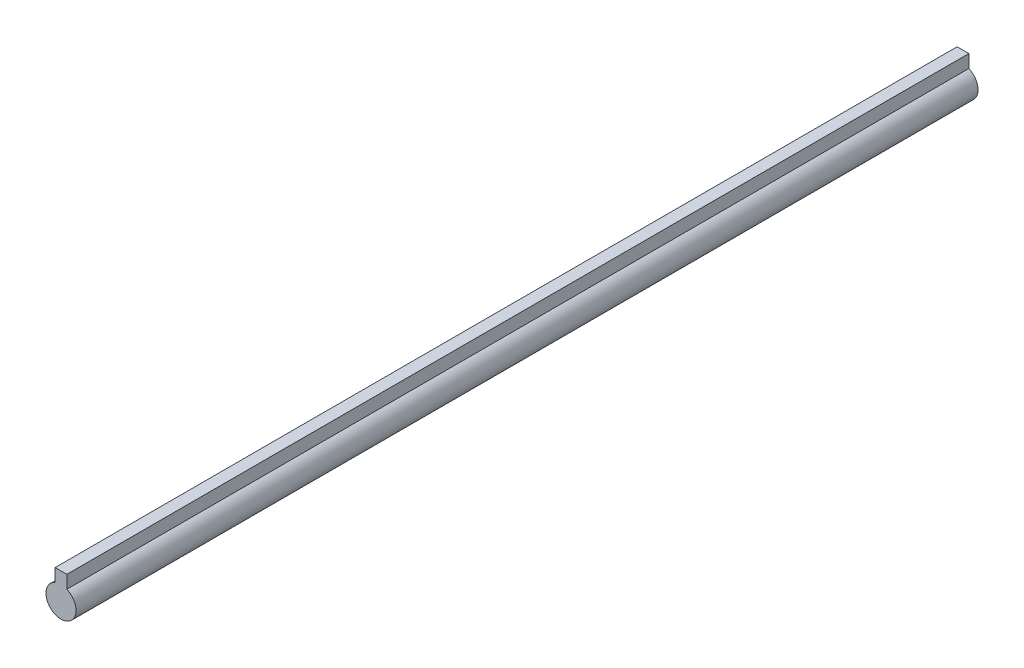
from build123d import *

# Parameters (mm, degrees)
BOSS_EXTRUDE1_DEPTH = 165


with BuildPart() as part:
    # Sketch2 → Boss-Extrude1 (new body)
    with BuildSketch(Plane.XY):
        with BuildLine():
            Line((1.075, 4.9), (1.075, 2.531180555))
            ThreePointArc((1.075, 2.531180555), (0, -2.75), (-1.075, 2.531180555))
            Line((-1.075, 2.531180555), (-1.075, 4.9))
            Line((-1.075, 4.9), (1.075, 4.9))
        make_face()
    extrude(amount=-BOSS_EXTRUDE1_DEPTH)


solid = part.part
